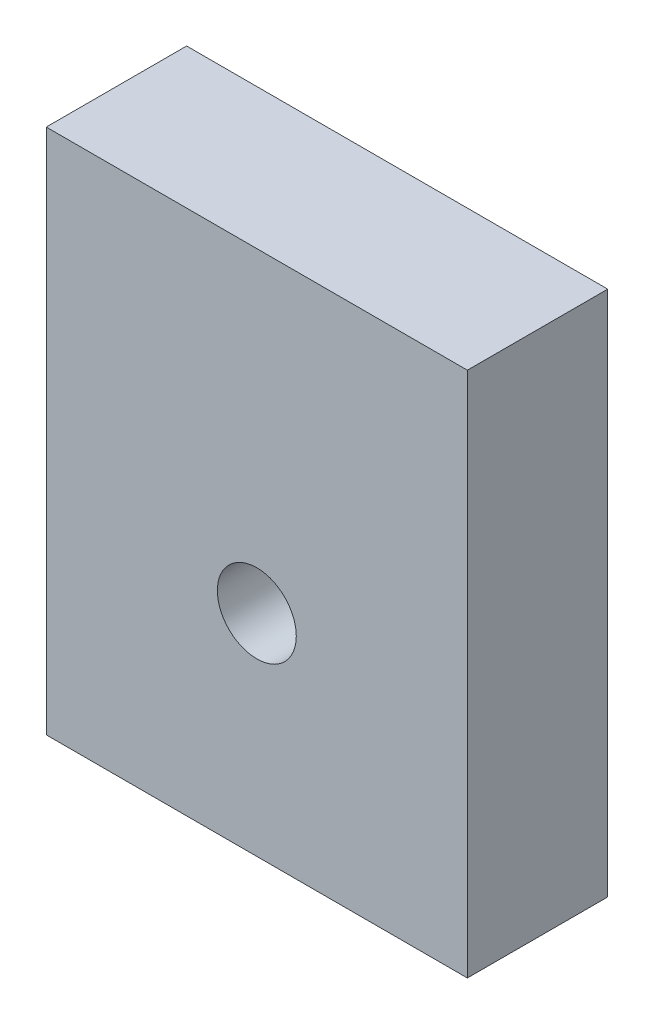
from build123d import *

# Parameters (mm, degrees)
SKETCH1_W                   = 152.4
SKETCH1_H                   = 50.8
BOSS_EXTRUDE1_DEPTH         = 190.5
F_3_4_0_75_DIAMETER_SLOT1_D = 28.575


with BuildPart() as part:
    # Sketch1 → Boss-Extrude1 (new body)
    with BuildSketch(Plane(origin=(0, 0, 0), x_dir=(1, 0, 0), z_dir=(0, 1, 0))):
        with Locations((16.301785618, -11.469538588)):
            Rectangle(SKETCH1_W, SKETCH1_H)
    extrude(amount=BOSS_EXTRUDE1_DEPTH)

    # 3_4 _0.75_ Diameter Slot1 (through all)
    with Locations(Plane.XY.offset(36.869538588)):
        with Locations((16.301785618, 76.2)):
            Hole(F_3_4_0_75_DIAMETER_SLOT1_D / 2)


solid = part.part
